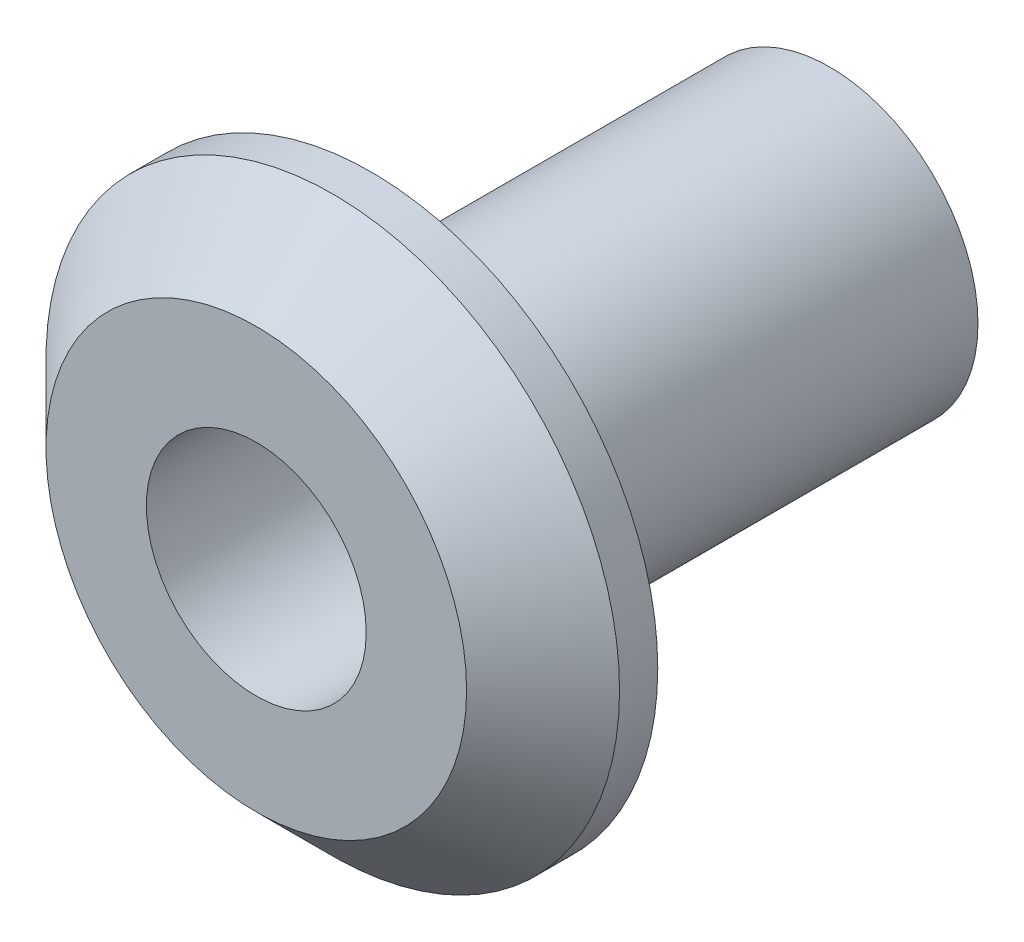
from build123d import *
from build123d.topology import SkipClean

# Parameters (mm, degrees)
CROQUIS1_R              = 7.5
CROQUIS1_R_2            = 1.55
SALIENTE_EXTRUIR1_DEPTH = 1.5
CHAFL_N1_SIZE           = 2
SALIENTE_EXTRUIR2_START = 12
CROQUIS2_R              = 3.875
CROQUIS2_R_2            = 1.55
SALIENTE_EXTRUIR2_DEPTH = 12
CROQUIS3_R              = 2.875
CORTAR_EXTRUIR1_DEPTH   = 12


with BuildPart() as part:
    # Croquis1 → Saliente-Extruir1 (new, symmetric)
    with BuildSketch(Plane.XY):
        Circle(CROQUIS1_R)
        Circle(CROQUIS1_R_2, mode=Mode.SUBTRACT)
    extrude(amount=SALIENTE_EXTRUIR1_DEPTH, both=True)

    # Chafl_n1
    chafl_n1_edges = [part.edges().sort_by_distance(p)[0] for p in [
        (-7.5, 0, 1.5),
    ]]
    chamfer(chafl_n1_edges, length=CHAFL_N1_SIZE)

    # Croquis2 → Saliente-Extruir2 (add)
    with SkipClean():  # the faces are left unmerged after this step: merging them gives an invalid solid
        with BuildSketch(Plane(origin=(0, 0, -1.5), x_dir=(-1, 0, 0), z_dir=(0, 0, -1)).offset(SALIENTE_EXTRUIR2_START)):
            with Locations(Location((0, 0, 0), (0, 0, 180))):
                Circle(CROQUIS2_R)
            Circle(CROQUIS2_R_2, mode=Mode.SUBTRACT)
        extrude(amount=-SALIENTE_EXTRUIR2_DEPTH)

    # Croquis3 → Cortar-Extruir1 (cut)
    with BuildSketch(Plane.XY.offset(1.5)):
        Circle(CROQUIS3_R)
    extrude(amount=-CORTAR_EXTRUIR1_DEPTH, mode=Mode.SUBTRACT)


solid = part.part
